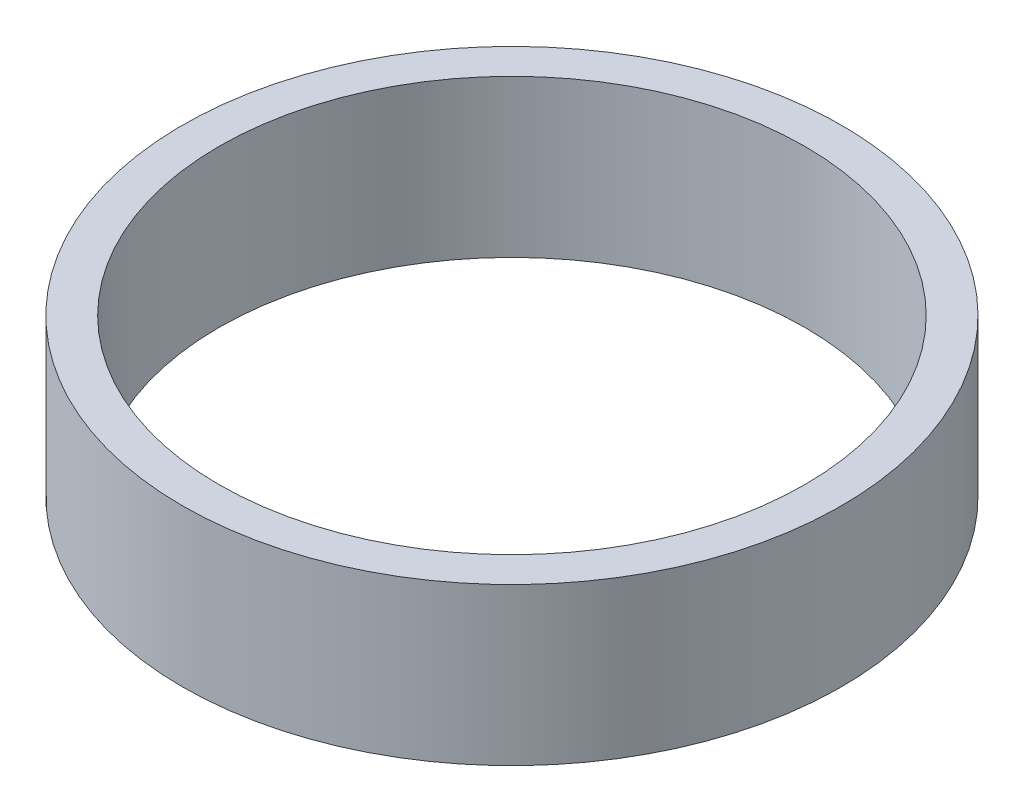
from build123d import *

# Parameters (mm, degrees)
SKETCH1_R           = 18
SKETCH1_R_2         = 16
BOSS_EXTRUDE1_DEPTH = 8.5663204


with BuildPart() as part:
    # Sketch1 → Boss-Extrude1 (new body)
    with BuildSketch(Plane(origin=(0, 0, 0), x_dir=(1, 0, 0), z_dir=(0, 1, 0))):
        with Locations(Location((0, 0, 0), (0, 0, 270))):
            Circle(SKETCH1_R)
        with Locations(Location((0, 0, 0), (0, 0, 270))):
            Circle(SKETCH1_R_2, mode=Mode.SUBTRACT)
    extrude(amount=BOSS_EXTRUDE1_DEPTH)


solid = part.part
